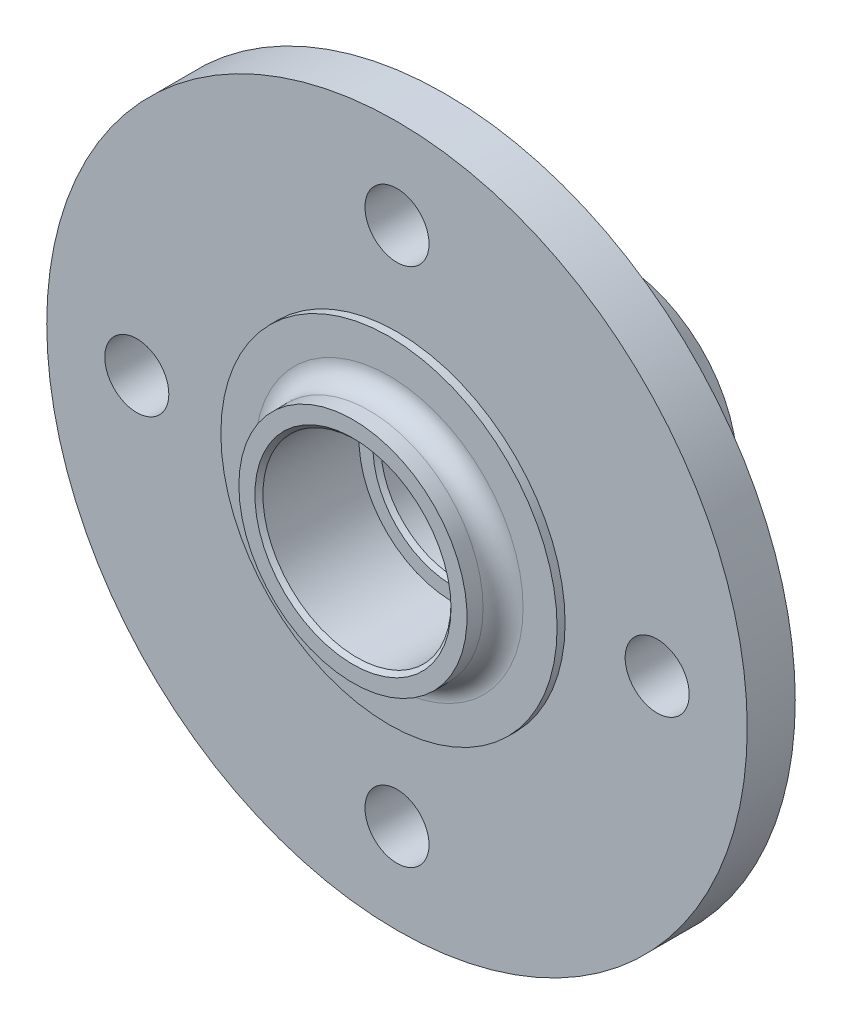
from build123d import *

# Parameters (mm, degrees)
ESQUISSE1_R             = 87.5
ESQUISSE1_R_2           = 8
EXTRUSION1_DEPTH        = 12
ESQUISSE2_R             = 42
EXTRUSION2_DEPTH        = 2
ESQUISSE3_R             = 28.5
EXTRUSION3_DEPTH        = 9
CONG_1_R                = 5
ESQUISSE5_R             = 23.5
ENL_V_MAT_EXTRU_1_DEPTH = 25
ESQUISSE6_R             = 26
ENL_V_MAT_EXTRU_2_DEPTH = 28.5
ESQUISSE7_R             = 19
ENL_V_MAT_EXTRU_3_DEPTH = 131.359119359
CHANFREIN1_SIZE         = 1


with BuildPart() as part:
    # Esquisse1 → Extrusion1 (new body)
    with BuildSketch(Plane.XY):
        Circle(ESQUISSE1_R)
        with Locations((0, 65)):
            Circle(ESQUISSE1_R_2, mode=Mode.SUBTRACT)
        with Locations((65, 0)):
            Circle(ESQUISSE1_R_2, mode=Mode.SUBTRACT)
        with Locations((0, -65)):
            Circle(ESQUISSE1_R_2, mode=Mode.SUBTRACT)
        with Locations((-65, 0)):
            Circle(ESQUISSE1_R_2, mode=Mode.SUBTRACT)
    extrude(amount=-EXTRUSION1_DEPTH)

    # Esquisse2 → Extrusion2 (add)
    with BuildSketch(Plane.XY):
        Circle(ESQUISSE2_R)
    extrude(amount=EXTRUSION2_DEPTH)

    # Esquisse3 → Extrusion3 (add)
    with BuildSketch(Plane.XY.offset(2)):
        Circle(ESQUISSE3_R)
    extrude(amount=EXTRUSION3_DEPTH)

    # Esquisse4 → R_volution1 (revolve)
    with BuildSketch(Plane(origin=(0, 0, 0), x_dir=(0, 0, -1), z_dir=(1, 0, 0)), mode=Mode.PRIVATE) as r_volution1_sk:
        Polygon((12, 40.234911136), (42.132958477, 36), (55, 30), (55, 0), (12, 0), align=None)
    revolve(r_volution1_sk.sketch.rotate(Axis((0, 0, 27.136602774), (0, 0, -1)), 90), axis=Axis((0, 0, 27.136602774), (0, 0, -1)))

    # Cong_1
    cong_1_edges = [part.edges().sort_by_distance(p)[0] for p in [
        (-28.5, 0, 2),
        (-40.234911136, 0, -12),
    ]]
    fillet(cong_1_edges, radius=CONG_1_R)

    # Esquisse5 → Enl_v. mat.-Extru.1 (cut)
    with BuildSketch(Plane.XY.offset(11)):
        Circle(ESQUISSE5_R)
    extrude(amount=-ENL_V_MAT_EXTRU_1_DEPTH, mode=Mode.SUBTRACT)

    # Esquisse6 → Enl_v. mat.-Extru.2 (cut)
    with BuildSketch(Plane(origin=(0, 0, -55), x_dir=(-1, 0, 0), z_dir=(0, 0, -1))):
        Circle(ESQUISSE6_R)
    extrude(amount=-ENL_V_MAT_EXTRU_2_DEPTH, mode=Mode.SUBTRACT)

    # Esquisse7 → Enl_v. mat.-Extru.3 (cut, through all)
    with BuildSketch(Plane.XY.offset(-14)):
        Circle(ESQUISSE7_R)
    extrude(amount=-ENL_V_MAT_EXTRU_3_DEPTH, mode=Mode.SUBTRACT)

    # Chanfrein1
    chanfrein1_edges = [part.edges().sort_by_distance(p)[0] for p in [
        (-23.5, 0, 11),
        (26, 0, -55),
        (-19, 0, -26.5),
        (-19, 0, -14),
    ]]
    chamfer(chanfrein1_edges, length=CHANFREIN1_SIZE)


solid = part.part
